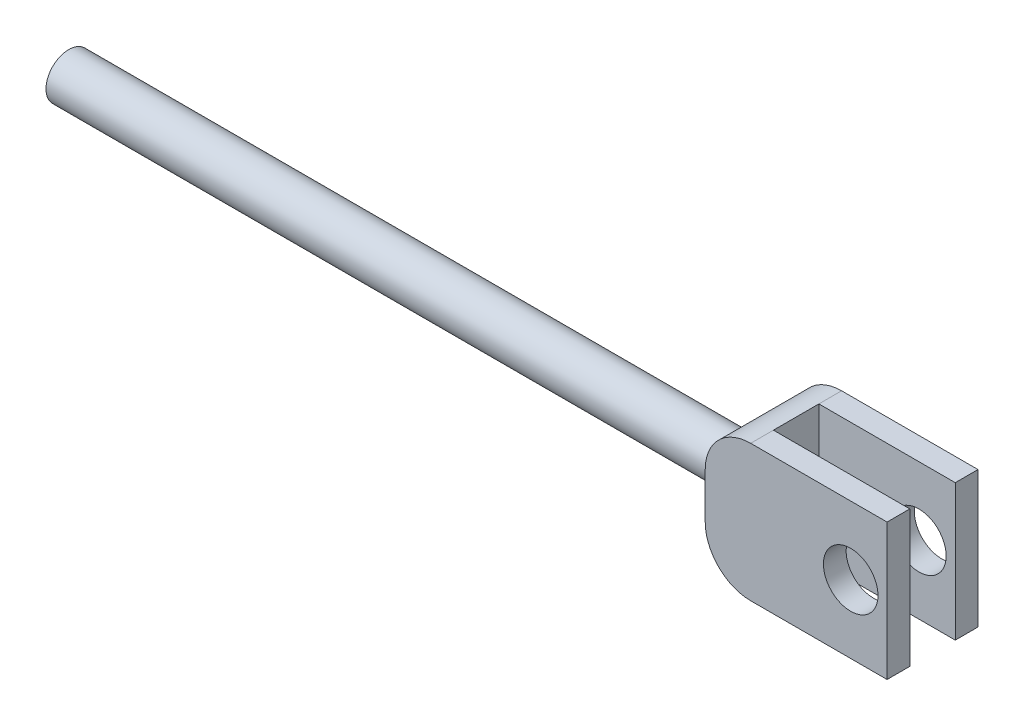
from build123d import *

# Parameters (mm, degrees)
ESQUISSE1_W      = 40
ESQUISSE1_H      = 30
EXTRUSION1_DEPTH = 20
CONG_1_R         = 10
ESQUISSE2_W      = 10
ESQUISSE2_H      = 64.734661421
EXTRUSION2_DEPTH = 30
ESQUISSE3_R      = 6
EXTRUSION3_DEPTH = 54.851648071
ESQUISSE4_R      = 5
EXTRUSION4_DEPTH = 150


with BuildPart() as part:
    # Esquisse1 → Extrusion1 (new body)
    with BuildSketch(Plane.XY):
        with Locations((-20, 15)):
            Rectangle(ESQUISSE1_W, ESQUISSE1_H)
    extrude(amount=EXTRUSION1_DEPTH)

    # Cong_1
    cong_1_edges = [part.edges().sort_by_distance(p)[0] for p in [
        (-40, 0, 10),
        (-40, 30, 10),
    ]]
    fillet(cong_1_edges, radius=CONG_1_R)

    # Esquisse2 → Extrusion2 (cut)
    with BuildSketch(Plane(origin=(0, 0, 0), x_dir=(0, 0, -1), z_dir=(1, 0, 0))):
        with Locations((-10, 23.687409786)):
            Rectangle(ESQUISSE2_W, ESQUISSE2_H)
    extrude(amount=-EXTRUSION2_DEPTH, mode=Mode.SUBTRACT)

    # Esquisse3 → Extrusion3 (cut, through all)
    with BuildSketch(Plane.XY.offset(20)):
        with Locations((-8, 15)):
            Circle(ESQUISSE3_R)
    extrude(amount=-EXTRUSION3_DEPTH, mode=Mode.SUBTRACT)

    # Esquisse4 → Extrusion4 (add)
    with BuildSketch(Plane.ZY.offset(40)):
        with Locations(Location((10, 15, 0), (0, 0, 270))):
            Circle(ESQUISSE4_R)
    extrude(amount=EXTRUSION4_DEPTH)


solid = part.part
